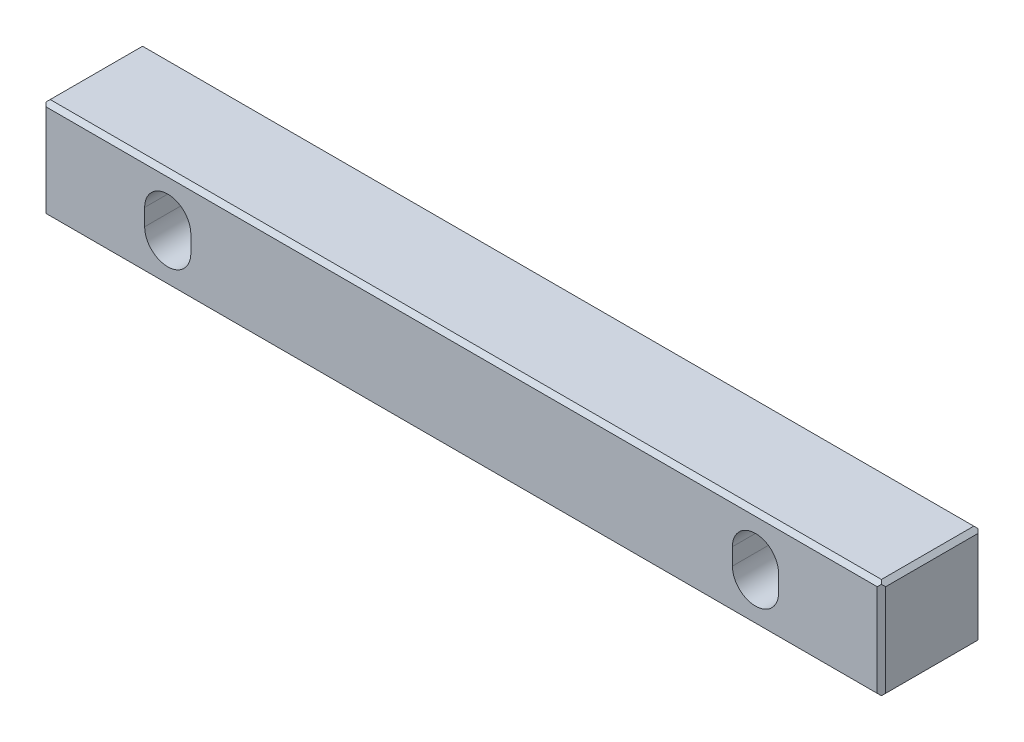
ISO-10303-21;
HEADER;
FILE_DESCRIPTION(('STEP AP214'),'2;1');
FILE_NAME('part.step','',(''),(''),'','','');
FILE_SCHEMA(('AUTOMOTIVE_DESIGN { 1 0 10303 214 1 1 1 1 }'));
ENDSEC;
DATA;
#1=APPLICATION_CONTEXT('core data for automotive mechanical design processes');
#2=APPLICATION_PROTOCOL_DEFINITION('international standard','automotive_design',2000,#1);
#3=PRODUCT_CONTEXT('',#1,'mechanical');
#4=PRODUCT('Part','Part','',(#3));
#5=PRODUCT_RELATED_PRODUCT_CATEGORY('part','',(#4));
#6=PRODUCT_DEFINITION_FORMATION('','',#4);
#7=PRODUCT_DEFINITION_CONTEXT('part definition',#1,'design');
#8=PRODUCT_DEFINITION('design','',#6,#7);
#9=PRODUCT_DEFINITION_SHAPE('','',#8);
#10=(LENGTH_UNIT() NAMED_UNIT(*) SI_UNIT(.MILLI.,.METRE.));
#11=(NAMED_UNIT(*) PLANE_ANGLE_UNIT() SI_UNIT($,.RADIAN.));
#12=(NAMED_UNIT(*) SI_UNIT($,.STERADIAN.) SOLID_ANGLE_UNIT());
#13=UNCERTAINTY_MEASURE_WITH_UNIT(LENGTH_MEASURE(1.E-05),#10,'distance_accuracy_value','');
#14=(GEOMETRIC_REPRESENTATION_CONTEXT(3) GLOBAL_UNCERTAINTY_ASSIGNED_CONTEXT((#13)) GLOBAL_UNIT_ASSIGNED_CONTEXT((#10,
#11,#12)) REPRESENTATION_CONTEXT('',''));
#15=CARTESIAN_POINT('',(0.,0.,0.));
#16=DIRECTION('',(0.,0.,1.));
#17=DIRECTION('',(1.,0.,0.));
#18=AXIS2_PLACEMENT_3D('',#15,#16,#17);
#19=CARTESIAN_POINT('',(371.720096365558,-215.4,188.52));
#20=DIRECTION('',(0.,-1.,0.));
#21=DIRECTION('',(0.,0.,-1.));
#22=AXIS2_PLACEMENT_3D('',#19,#20,#21);
#23=PLANE('',#22);
#24=DIRECTION('',(0.,0.,1.));
#25=VECTOR('',#24,1.);
#26=CARTESIAN_POINT('',(471.220096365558,-215.4,182.52));
#27=LINE('',#26,#25);
#28=CARTESIAN_POINT('',(471.220096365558,-215.4,188.02));
#29=VERTEX_POINT('',#28);
#30=CARTESIAN_POINT('',(471.220096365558,-215.4,177.02));
#31=VERTEX_POINT('',#30);
#32=EDGE_CURVE('E284',#29,#31,#27,.F.);
#33=ORIENTED_EDGE('',*,*,#32,.F.);
#34=DIRECTION('',(1.,0.,0.));
#35=VECTOR('',#34,1.);
#36=CARTESIAN_POINT('',(421.720096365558,-215.4,188.02));
#37=LINE('',#36,#35);
#38=CARTESIAN_POINT('',(372.220096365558,-215.4,188.02));
#39=VERTEX_POINT('',#38);
#40=EDGE_CURVE('E233',#39,#29,#37,.T.);
#41=ORIENTED_EDGE('',*,*,#40,.F.);
#42=DIRECTION('',(0.,0.,1.));
#43=VECTOR('',#42,1.);
#44=CARTESIAN_POINT('',(372.220096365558,-215.4,182.52));
#45=LINE('',#44,#43);
#46=CARTESIAN_POINT('',(372.220096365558,-215.4,177.02));
#47=VERTEX_POINT('',#46);
#48=EDGE_CURVE('E264',#47,#39,#45,.T.);
#49=ORIENTED_EDGE('',*,*,#48,.F.);
#50=DIRECTION('',(1.,0.,0.));
#51=VECTOR('',#50,1.);
#52=CARTESIAN_POINT('',(421.720096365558,-215.4,177.02));
#53=LINE('',#52,#51);
#54=EDGE_CURVE('E276',#47,#31,#53,.T.);
#55=ORIENTED_EDGE('',*,*,#54,.T.);
#56=EDGE_LOOP('',(#33,#41,#49,#55));
#57=FACE_BOUND('',#56,.T.);
#58=ADVANCED_FACE('F16',(#57),#23,.T.);
#59=CARTESIAN_POINT('',(471.470096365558,-215.15,182.52));
#60=DIRECTION('',(0.707106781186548,-0.707106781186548,0.));
#61=DIRECTION('',(0.707106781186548,0.707106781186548,0.));
#62=AXIS2_PLACEMENT_3D('',#59,#60,#61);
#63=PLANE('',#62);
#64=DIRECTION('',(0.577350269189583,0.577350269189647,-0.577350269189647));
#65=VECTOR('',#64,1.);
#66=CARTESIAN_POINT('',(471.220096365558,-215.4,177.02));
#67=LINE('',#66,#65);
#68=CARTESIAN_POINT('',(471.470096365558,-215.15,176.77));
#69=VERTEX_POINT('',#68);
#70=EDGE_CURVE('E274',#31,#69,#67,.T.);
#71=ORIENTED_EDGE('',*,*,#70,.T.);
#72=DIRECTION('',(0.577350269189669,0.577350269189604,0.577350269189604));
#73=VECTOR('',#72,1.);
#74=CARTESIAN_POINT('',(471.470096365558,-215.15,176.77));
#75=LINE('',#74,#73);
#76=CARTESIAN_POINT('',(471.720096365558,-214.9,177.02));
#77=VERTEX_POINT('',#76);
#78=EDGE_CURVE('E282',#69,#77,#75,.T.);
#79=ORIENTED_EDGE('',*,*,#78,.T.);
#80=DIRECTION('',(0.,0.,-1.));
#81=VECTOR('',#80,1.);
#82=CARTESIAN_POINT('',(471.720096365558,-214.9,188.52));
#83=LINE('',#82,#81);
#84=CARTESIAN_POINT('',(471.720096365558,-214.9,188.02));
#85=VERTEX_POINT('',#84);
#86=EDGE_CURVE('E211',#85,#77,#83,.T.);
#87=ORIENTED_EDGE('',*,*,#86,.F.);
#88=DIRECTION('',(0.577350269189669,0.577350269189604,-0.577350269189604));
#89=VECTOR('',#88,1.);
#90=CARTESIAN_POINT('',(471.470096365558,-215.15,188.27));
#91=LINE('',#90,#89);
#92=CARTESIAN_POINT('',(471.470096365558,-215.15,188.27));
#93=VERTEX_POINT('',#92);
#94=EDGE_CURVE('E244',#93,#85,#91,.T.);
#95=ORIENTED_EDGE('',*,*,#94,.F.);
#96=DIRECTION('',(0.577350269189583,0.577350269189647,0.577350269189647));
#97=VECTOR('',#96,1.);
#98=CARTESIAN_POINT('',(471.220096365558,-215.4,188.02));
#99=LINE('',#98,#97);
#100=EDGE_CURVE('E230',#29,#93,#99,.T.);
#101=ORIENTED_EDGE('',*,*,#100,.F.);
#102=ORIENTED_EDGE('',*,*,#32,.T.);
#103=EDGE_LOOP('',(#71,#79,#87,#95,#101,#102));
#104=FACE_BOUND('',#103,.T.);
#105=ADVANCED_FACE('F427',(#104),#63,.T.);
#106=CARTESIAN_POINT('',(471.470096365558,-209.4,176.77));
#107=DIRECTION('',(-0.707106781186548,0.,0.707106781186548));
#108=DIRECTION('',(0.707106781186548,0.,0.707106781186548));
#109=AXIS2_PLACEMENT_3D('',#106,#107,#108);
#110=PLANE('',#109);
#111=DIRECTION('',(-0.577350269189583,-0.577350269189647,-0.577350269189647));
#112=VECTOR('',#111,1.);
#113=CARTESIAN_POINT('',(471.470096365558,-203.65,176.77));
#114=LINE('',#113,#112);
#115=CARTESIAN_POINT('',(471.470096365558,-203.65,176.77));
#116=VERTEX_POINT('',#115);
#117=CARTESIAN_POINT('',(471.220096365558,-203.9,176.52));
#118=VERTEX_POINT('',#117);
#119=EDGE_CURVE('E278',#116,#118,#114,.T.);
#120=ORIENTED_EDGE('',*,*,#119,.F.);
#121=DIRECTION('',(-0.577350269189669,0.577350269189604,-0.577350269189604));
#122=VECTOR('',#121,1.);
#123=CARTESIAN_POINT('',(471.720096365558,-203.9,177.02));
#124=LINE('',#123,#122);
#125=CARTESIAN_POINT('',(471.720096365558,-203.9,177.02));
#126=VERTEX_POINT('',#125);
#127=EDGE_CURVE('E280',#126,#116,#124,.T.);
#128=ORIENTED_EDGE('',*,*,#127,.F.);
#129=DIRECTION('',(0.,1.,0.));
#130=VECTOR('',#129,1.);
#131=CARTESIAN_POINT('',(471.720096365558,-215.4,177.02));
#132=LINE('',#131,#130);
#133=EDGE_CURVE('E204',#77,#126,#132,.T.);
#134=ORIENTED_EDGE('',*,*,#133,.F.);
#135=ORIENTED_EDGE('',*,*,#78,.F.);
#136=DIRECTION('',(-0.577350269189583,0.577350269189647,-0.577350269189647));
#137=VECTOR('',#136,1.);
#138=CARTESIAN_POINT('',(471.470096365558,-215.15,176.77));
#139=LINE('',#138,#137);
#140=CARTESIAN_POINT('',(471.220096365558,-214.9,176.52));
#141=VERTEX_POINT('',#140);
#142=EDGE_CURVE('E272',#69,#141,#139,.T.);
#143=ORIENTED_EDGE('',*,*,#142,.T.);
#144=DIRECTION('',(0.,1.,0.));
#145=VECTOR('',#144,1.);
#146=CARTESIAN_POINT('',(471.220096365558,78.6,176.52));
#147=LINE('',#146,#145);
#148=EDGE_CURVE('E312',#118,#141,#147,.F.);
#149=ORIENTED_EDGE('',*,*,#148,.F.);
#150=EDGE_LOOP('',(#120,#128,#134,#135,#143,#149));
#151=FACE_BOUND('',#150,.T.);
#152=ADVANCED_FACE('F409',(#151),#110,.F.);
#153=CARTESIAN_POINT('',(421.720096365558,-215.15,176.77));
#154=DIRECTION('',(0.,0.707106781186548,0.707106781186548));
#155=DIRECTION('',(0.,-0.707106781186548,0.707106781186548));
#156=AXIS2_PLACEMENT_3D('',#153,#154,#155);
#157=PLANE('',#156);
#158=ORIENTED_EDGE('',*,*,#142,.F.);
#159=ORIENTED_EDGE('',*,*,#70,.F.);
#160=ORIENTED_EDGE('',*,*,#54,.F.);
#161=DIRECTION('',(0.577350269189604,-0.577350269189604,0.577350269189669));
#162=VECTOR('',#161,1.);
#163=CARTESIAN_POINT('',(371.970096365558,-215.15,176.77));
#164=LINE('',#163,#162);
#165=CARTESIAN_POINT('',(371.970096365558,-215.15,176.77));
#166=VERTEX_POINT('',#165);
#167=EDGE_CURVE('E258',#166,#47,#164,.T.);
#168=ORIENTED_EDGE('',*,*,#167,.F.);
#169=DIRECTION('',(0.577350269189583,0.577350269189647,-0.577350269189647));
#170=VECTOR('',#169,1.);
#171=CARTESIAN_POINT('',(371.970096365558,-215.15,176.77));
#172=LINE('',#171,#170);
#173=CARTESIAN_POINT('',(372.220096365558,-214.9,176.52));
#174=VERTEX_POINT('',#173);
#175=EDGE_CURVE('E266',#166,#174,#172,.T.);
#176=ORIENTED_EDGE('',*,*,#175,.T.);
#177=DIRECTION('',(-1.,0.,0.));
#178=VECTOR('',#177,1.);
#179=CARTESIAN_POINT('',(512.25,-214.9,176.52));
#180=LINE('',#179,#178);
#181=EDGE_CURVE('E315',#141,#174,#180,.T.);
#182=ORIENTED_EDGE('',*,*,#181,.F.);
#183=EDGE_LOOP('',(#158,#159,#160,#168,#176,#182));
#184=FACE_BOUND('',#183,.T.);
#185=ADVANCED_FACE('F418',(#184),#157,.F.);
#186=CARTESIAN_POINT('',(371.970096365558,-209.4,176.77));
#187=DIRECTION('',(0.707106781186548,0.,0.707106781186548));
#188=DIRECTION('',(0.707106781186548,0.,-0.707106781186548));
#189=AXIS2_PLACEMENT_3D('',#186,#187,#188);
#190=PLANE('',#189);
#191=ORIENTED_EDGE('',*,*,#175,.F.);
#192=DIRECTION('',(0.577350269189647,-0.577350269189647,-0.577350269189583));
#193=VECTOR('',#192,1.);
#194=CARTESIAN_POINT('',(371.720096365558,-214.9,177.02));
#195=LINE('',#194,#193);
#196=CARTESIAN_POINT('',(371.720096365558,-214.9,177.02));
#197=VERTEX_POINT('',#196);
#198=EDGE_CURVE('E261',#197,#166,#195,.T.);
#199=ORIENTED_EDGE('',*,*,#198,.F.);
#200=DIRECTION('',(0.,1.,0.));
#201=VECTOR('',#200,1.);
#202=CARTESIAN_POINT('',(371.720096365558,-203.4,177.02));
#203=LINE('',#202,#201);
#204=CARTESIAN_POINT('',(371.720096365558,-203.9,177.02));
#205=VERTEX_POINT('',#204);
#206=EDGE_CURVE('E324',#205,#197,#203,.F.);
#207=ORIENTED_EDGE('',*,*,#206,.F.);
#208=DIRECTION('',(-0.577350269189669,-0.577350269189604,0.577350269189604));
#209=VECTOR('',#208,1.);
#210=CARTESIAN_POINT('',(371.970096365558,-203.65,176.77));
#211=LINE('',#210,#209);
#212=CARTESIAN_POINT('',(371.970096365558,-203.65,176.77));
#213=VERTEX_POINT('',#212);
#214=EDGE_CURVE('E268',#213,#205,#211,.T.);
#215=ORIENTED_EDGE('',*,*,#214,.F.);
#216=DIRECTION('',(-0.577350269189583,0.577350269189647,0.577350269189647));
#217=VECTOR('',#216,1.);
#218=CARTESIAN_POINT('',(372.220096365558,-203.9,176.52));
#219=LINE('',#218,#217);
#220=CARTESIAN_POINT('',(372.220096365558,-203.9,176.52));
#221=VERTEX_POINT('',#220);
#222=EDGE_CURVE('E270',#221,#213,#219,.T.);
#223=ORIENTED_EDGE('',*,*,#222,.F.);
#224=DIRECTION('',(0.,1.,0.));
#225=VECTOR('',#224,1.);
#226=CARTESIAN_POINT('',(372.220096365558,78.6,176.52));
#227=LINE('',#226,#225);
#228=EDGE_CURVE('E318',#174,#221,#227,.T.);
#229=ORIENTED_EDGE('',*,*,#228,.F.);
#230=EDGE_LOOP('',(#191,#199,#207,#215,#223,#229));
#231=FACE_BOUND('',#230,.T.);
#232=ADVANCED_FACE('F377',(#231),#190,.F.);
#233=CARTESIAN_POINT('',(371.970096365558,-215.15,182.52));
#234=DIRECTION('',(-0.707106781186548,-0.707106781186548,0.));
#235=DIRECTION('',(0.707106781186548,-0.707106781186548,0.));
#236=AXIS2_PLACEMENT_3D('',#233,#234,#235);
#237=PLANE('',#236);
#238=ORIENTED_EDGE('',*,*,#198,.T.);
#239=ORIENTED_EDGE('',*,*,#167,.T.);
#240=ORIENTED_EDGE('',*,*,#48,.T.);
#241=DIRECTION('',(0.577350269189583,-0.577350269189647,-0.577350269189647));
#242=VECTOR('',#241,1.);
#243=CARTESIAN_POINT('',(371.970096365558,-215.15,188.27));
#244=LINE('',#243,#242);
#245=CARTESIAN_POINT('',(371.970096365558,-215.15,188.27));
#246=VERTEX_POINT('',#245);
#247=EDGE_CURVE('E236',#246,#39,#244,.T.);
#248=ORIENTED_EDGE('',*,*,#247,.F.);
#249=DIRECTION('',(0.577350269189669,-0.577350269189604,0.577350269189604));
#250=VECTOR('',#249,1.);
#251=CARTESIAN_POINT('',(371.720096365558,-214.9,188.02));
#252=LINE('',#251,#250);
#253=CARTESIAN_POINT('',(371.720096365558,-214.9,188.02));
#254=VERTEX_POINT('',#253);
#255=EDGE_CURVE('E219',#254,#246,#252,.T.);
#256=ORIENTED_EDGE('',*,*,#255,.F.);
#257=DIRECTION('',(0.,0.,1.));
#258=VECTOR('',#257,1.);
#259=CARTESIAN_POINT('',(371.720096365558,-214.9,188.52));
#260=LINE('',#259,#258);
#261=EDGE_CURVE('E327',#197,#254,#260,.T.);
#262=ORIENTED_EDGE('',*,*,#261,.F.);
#263=EDGE_LOOP('',(#238,#239,#240,#248,#256,#262));
#264=FACE_BOUND('',#263,.T.);
#265=ADVANCED_FACE('F421',(#264),#237,.T.);
#266=CARTESIAN_POINT('',(389.470096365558,-210.4,189.7200024));
#267=DIRECTION('',(1.,0.,0.));
#268=DIRECTION('',(0.,0.,-1.));
#269=AXIS2_PLACEMENT_3D('',#266,#267,#268);
#270=PLANE('',#269);
#271=DIRECTION('',(0.,0.,-1.));
#272=VECTOR('',#271,1.);
#273=CARTESIAN_POINT('',(389.470096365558,-210.4,189.7200024));
#274=LINE('',#273,#272);
#275=CARTESIAN_POINT('',(389.470096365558,-210.4,176.52));
#276=VERTEX_POINT('',#275);
#277=CARTESIAN_POINT('',(389.470096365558,-210.4,188.52));
#278=VERTEX_POINT('',#277);
#279=EDGE_CURVE('E179',#276,#278,#274,.F.);
#280=ORIENTED_EDGE('',*,*,#279,.T.);
#281=DIRECTION('',(0.,1.,0.));
#282=VECTOR('',#281,1.);
#283=CARTESIAN_POINT('',(389.470096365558,78.6,188.52));
#284=LINE('',#283,#282);
#285=CARTESIAN_POINT('',(389.470096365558,-208.4,188.52));
#286=VERTEX_POINT('',#285);
#287=EDGE_CURVE('E299',#278,#286,#284,.T.);
#288=ORIENTED_EDGE('',*,*,#287,.T.);
#289=DIRECTION('',(0.,0.,-1.));
#290=VECTOR('',#289,1.);
#291=CARTESIAN_POINT('',(389.470096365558,-208.4,189.7200024));
#292=LINE('',#291,#290);
#293=CARTESIAN_POINT('',(389.470096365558,-208.4,176.52));
#294=VERTEX_POINT('',#293);
#295=EDGE_CURVE('E194',#286,#294,#292,.T.);
#296=ORIENTED_EDGE('',*,*,#295,.T.);
#297=DIRECTION('',(0.,1.,0.));
#298=VECTOR('',#297,1.);
#299=CARTESIAN_POINT('',(389.470096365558,78.6,176.52));
#300=LINE('',#299,#298);
#301=EDGE_CURVE('E191',#276,#294,#300,.T.);
#302=ORIENTED_EDGE('',*,*,#301,.F.);
#303=EDGE_LOOP('',(#280,#288,#296,#302));
#304=FACE_BOUND('',#303,.T.);
#305=ADVANCED_FACE('F192',(#304),#270,.F.);
#306=CARTESIAN_POINT('',(386.720096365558,-208.4,189.7200024));
#307=DIRECTION('',(0.,0.,-1.));
#308=DIRECTION('',(-1.,0.,0.));
#309=AXIS2_PLACEMENT_3D('',#306,#307,#308);
#310=CYLINDRICAL_SURFACE('',#309,2.75);
#311=ORIENTED_EDGE('',*,*,#295,.F.);
#312=CARTESIAN_POINT('',(386.720096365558,-208.4,188.52));
#313=DIRECTION('',(0.,0.,-1.));
#314=DIRECTION('',(-1.,0.,0.));
#315=AXIS2_PLACEMENT_3D('',#312,#313,#314);
#316=CIRCLE('',#315,2.75);
#317=CARTESIAN_POINT('',(383.970096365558,-208.4,188.52));
#318=VERTEX_POINT('',#317);
#319=EDGE_CURVE('E297',#286,#318,#316,.F.);
#320=ORIENTED_EDGE('',*,*,#319,.T.);
#321=DIRECTION('',(0.,0.,1.));
#322=VECTOR('',#321,1.);
#323=CARTESIAN_POINT('',(383.970096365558,-208.4,189.7200024));
#324=LINE('',#323,#322);
#325=CARTESIAN_POINT('',(383.970096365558,-208.4,176.52));
#326=VERTEX_POINT('',#325);
#327=EDGE_CURVE('E255',#318,#326,#324,.F.);
#328=ORIENTED_EDGE('',*,*,#327,.T.);
#329=CARTESIAN_POINT('',(386.720096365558,-208.4,176.52));
#330=DIRECTION('',(0.,0.,-1.));
#331=DIRECTION('',(-1.,0.,0.));
#332=AXIS2_PLACEMENT_3D('',#329,#330,#331);
#333=CIRCLE('',#332,2.75);
#334=EDGE_CURVE('E198',#294,#326,#333,.F.);
#335=ORIENTED_EDGE('',*,*,#334,.F.);
#336=EDGE_LOOP('',(#311,#320,#328,#335));
#337=FACE_BOUND('',#336,.T.);
#338=ADVANCED_FACE('F484',(#337),#310,.F.);
#339=CARTESIAN_POINT('',(383.970096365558,-208.4,189.7200024));
#340=DIRECTION('',(-1.,0.,0.));
#341=DIRECTION('',(0.,0.,1.));
#342=AXIS2_PLACEMENT_3D('',#339,#340,#341);
#343=PLANE('',#342);
#344=ORIENTED_EDGE('',*,*,#327,.F.);
#345=DIRECTION('',(0.,1.,0.));
#346=VECTOR('',#345,1.);
#347=CARTESIAN_POINT('',(383.970096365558,78.6,188.52));
#348=LINE('',#347,#346);
#349=CARTESIAN_POINT('',(383.970096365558,-210.4,188.52));
#350=VERTEX_POINT('',#349);
#351=EDGE_CURVE('E296',#318,#350,#348,.F.);
#352=ORIENTED_EDGE('',*,*,#351,.T.);
#353=DIRECTION('',(0.,0.,-1.));
#354=VECTOR('',#353,1.);
#355=CARTESIAN_POINT('',(383.970096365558,-210.4,189.7200024));
#356=LINE('',#355,#354);
#357=CARTESIAN_POINT('',(383.970096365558,-210.4,176.52));
#358=VERTEX_POINT('',#357);
#359=EDGE_CURVE('E174',#350,#358,#356,.T.);
#360=ORIENTED_EDGE('',*,*,#359,.T.);
#361=DIRECTION('',(0.,1.,0.));
#362=VECTOR('',#361,1.);
#363=CARTESIAN_POINT('',(383.970096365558,78.6,176.52));
#364=LINE('',#363,#362);
#365=EDGE_CURVE('E201',#326,#358,#364,.F.);
#366=ORIENTED_EDGE('',*,*,#365,.F.);
#367=EDGE_LOOP('',(#344,#352,#360,#366));
#368=FACE_BOUND('',#367,.T.);
#369=ADVANCED_FACE('F481',(#368),#343,.F.);
#370=CARTESIAN_POINT('',(386.720096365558,-210.4,189.7200024));
#371=DIRECTION('',(0.,0.,-1.));
#372=DIRECTION('',(-1.,0.,0.));
#373=AXIS2_PLACEMENT_3D('',#370,#371,#372);
#374=CYLINDRICAL_SURFACE('',#373,2.75);
#375=ORIENTED_EDGE('',*,*,#279,.F.);
#376=CARTESIAN_POINT('',(386.720096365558,-210.4,176.52));
#377=DIRECTION('',(0.,0.,-1.));
#378=DIRECTION('',(-1.,0.,0.));
#379=AXIS2_PLACEMENT_3D('',#376,#377,#378);
#380=CIRCLE('',#379,2.75);
#381=EDGE_CURVE('E19',#358,#276,#380,.F.);
#382=ORIENTED_EDGE('',*,*,#381,.F.);
#383=ORIENTED_EDGE('',*,*,#359,.F.);
#384=CARTESIAN_POINT('',(386.720096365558,-210.4,188.52));
#385=DIRECTION('',(0.,0.,-1.));
#386=DIRECTION('',(-1.,0.,0.));
#387=AXIS2_PLACEMENT_3D('',#384,#385,#386);
#388=CIRCLE('',#387,2.75);
#389=EDGE_CURVE('E185',#350,#278,#388,.F.);
#390=ORIENTED_EDGE('',*,*,#389,.T.);
#391=EDGE_LOOP('',(#375,#382,#383,#390));
#392=FACE_BOUND('',#391,.T.);
#393=ADVANCED_FACE('F181',(#392),#374,.F.);
#394=CARTESIAN_POINT('',(459.470096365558,-210.4,189.7200024));
#395=DIRECTION('',(1.,0.,0.));
#396=DIRECTION('',(0.,0.,-1.));
#397=AXIS2_PLACEMENT_3D('',#394,#395,#396);
#398=PLANE('',#397);
#399=DIRECTION('',(0.,0.,-1.));
#400=VECTOR('',#399,1.);
#401=CARTESIAN_POINT('',(459.470096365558,-208.4,189.7200024));
#402=LINE('',#401,#400);
#403=CARTESIAN_POINT('',(459.470096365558,-208.4,188.52));
#404=VERTEX_POINT('',#403);
#405=CARTESIAN_POINT('',(459.470096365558,-208.4,176.52));
#406=VERTEX_POINT('',#405);
#407=EDGE_CURVE('E188',#404,#406,#402,.T.);
#408=ORIENTED_EDGE('',*,*,#407,.T.);
#409=DIRECTION('',(0.,1.,0.));
#410=VECTOR('',#409,1.);
#411=CARTESIAN_POINT('',(459.470096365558,78.6,176.52));
#412=LINE('',#411,#410);
#413=CARTESIAN_POINT('',(459.470096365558,-210.4,176.52));
#414=VERTEX_POINT('',#413);
#415=EDGE_CURVE('E304',#414,#406,#412,.T.);
#416=ORIENTED_EDGE('',*,*,#415,.F.);
#417=DIRECTION('',(0.,0.,-1.));
#418=VECTOR('',#417,1.);
#419=CARTESIAN_POINT('',(459.470096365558,-210.4,189.7200024));
#420=LINE('',#419,#418);
#421=CARTESIAN_POINT('',(459.470096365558,-210.4,188.52));
#422=VERTEX_POINT('',#421);
#423=EDGE_CURVE('E247',#414,#422,#420,.F.);
#424=ORIENTED_EDGE('',*,*,#423,.T.);
#425=DIRECTION('',(0.,1.,0.));
#426=VECTOR('',#425,1.);
#427=CARTESIAN_POINT('',(459.470096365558,78.6,188.52));
#428=LINE('',#427,#426);
#429=EDGE_CURVE('E294',#422,#404,#428,.T.);
#430=ORIENTED_EDGE('',*,*,#429,.T.);
#431=EDGE_LOOP('',(#408,#416,#424,#430));
#432=FACE_BOUND('',#431,.T.);
#433=ADVANCED_FACE('F474',(#432),#398,.F.);
#434=CARTESIAN_POINT('',(456.720096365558,-208.4,189.7200024));
#435=DIRECTION('',(0.,0.,-1.));
#436=DIRECTION('',(-1.,0.,0.));
#437=AXIS2_PLACEMENT_3D('',#434,#435,#436);
#438=CYLINDRICAL_SURFACE('',#437,2.75);
#439=DIRECTION('',(0.,0.,1.));
#440=VECTOR('',#439,1.);
#441=CARTESIAN_POINT('',(453.970096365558,-208.4,189.7200024));
#442=LINE('',#441,#440);
#443=CARTESIAN_POINT('',(453.970096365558,-208.4,188.52));
#444=VERTEX_POINT('',#443);
#445=CARTESIAN_POINT('',(453.970096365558,-208.4,176.52));
#446=VERTEX_POINT('',#445);
#447=EDGE_CURVE('E251',#444,#446,#442,.F.);
#448=ORIENTED_EDGE('',*,*,#447,.T.);
#449=CARTESIAN_POINT('',(456.720096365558,-208.4,176.52));
#450=DIRECTION('',(0.,0.,-1.));
#451=DIRECTION('',(-1.,0.,0.));
#452=AXIS2_PLACEMENT_3D('',#449,#450,#451);
#453=CIRCLE('',#452,2.75);
#454=EDGE_CURVE('E300',#406,#446,#453,.F.);
#455=ORIENTED_EDGE('',*,*,#454,.F.);
#456=ORIENTED_EDGE('',*,*,#407,.F.);
#457=CARTESIAN_POINT('',(456.720096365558,-208.4,188.52));
#458=DIRECTION('',(0.,0.,-1.));
#459=DIRECTION('',(-1.,0.,0.));
#460=AXIS2_PLACEMENT_3D('',#457,#458,#459);
#461=CIRCLE('',#460,2.75);
#462=EDGE_CURVE('E292',#404,#444,#461,.F.);
#463=ORIENTED_EDGE('',*,*,#462,.T.);
#464=EDGE_LOOP('',(#448,#455,#456,#463));
#465=FACE_BOUND('',#464,.T.);
#466=ADVANCED_FACE('F470',(#465),#438,.F.);
#467=CARTESIAN_POINT('',(453.970096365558,-208.4,189.7200024));
#468=DIRECTION('',(-1.,0.,0.));
#469=DIRECTION('',(0.,0.,1.));
#470=AXIS2_PLACEMENT_3D('',#467,#468,#469);
#471=PLANE('',#470);
#472=DIRECTION('',(0.,0.,-1.));
#473=VECTOR('',#472,1.);
#474=CARTESIAN_POINT('',(453.970096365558,-210.4,189.7200024));
#475=LINE('',#474,#473);
#476=CARTESIAN_POINT('',(453.970096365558,-210.4,188.52));
#477=VERTEX_POINT('',#476);
#478=CARTESIAN_POINT('',(453.970096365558,-210.4,176.52));
#479=VERTEX_POINT('',#478);
#480=EDGE_CURVE('E249',#477,#479,#475,.T.);
#481=ORIENTED_EDGE('',*,*,#480,.T.);
#482=DIRECTION('',(0.,1.,0.));
#483=VECTOR('',#482,1.);
#484=CARTESIAN_POINT('',(453.970096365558,78.6,176.52));
#485=LINE('',#484,#483);
#486=EDGE_CURVE('E303',#446,#479,#485,.F.);
#487=ORIENTED_EDGE('',*,*,#486,.F.);
#488=ORIENTED_EDGE('',*,*,#447,.F.);
#489=DIRECTION('',(0.,1.,0.));
#490=VECTOR('',#489,1.);
#491=CARTESIAN_POINT('',(453.970096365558,78.6,188.52));
#492=LINE('',#491,#490);
#493=EDGE_CURVE('E291',#444,#477,#492,.F.);
#494=ORIENTED_EDGE('',*,*,#493,.T.);
#495=EDGE_LOOP('',(#481,#487,#488,#494));
#496=FACE_BOUND('',#495,.T.);
#497=ADVANCED_FACE('F466',(#496),#471,.F.);
#498=CARTESIAN_POINT('',(456.720096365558,-210.4,189.7200024));
#499=DIRECTION('',(0.,0.,-1.));
#500=DIRECTION('',(-1.,0.,0.));
#501=AXIS2_PLACEMENT_3D('',#498,#499,#500);
#502=CYLINDRICAL_SURFACE('',#501,2.75);
#503=ORIENTED_EDGE('',*,*,#423,.F.);
#504=CARTESIAN_POINT('',(456.720096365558,-210.4,176.52));
#505=DIRECTION('',(0.,0.,-1.));
#506=DIRECTION('',(-1.,0.,0.));
#507=AXIS2_PLACEMENT_3D('',#504,#505,#506);
#508=CIRCLE('',#507,2.75);
#509=EDGE_CURVE('E305',#479,#414,#508,.F.);
#510=ORIENTED_EDGE('',*,*,#509,.F.);
#511=ORIENTED_EDGE('',*,*,#480,.F.);
#512=CARTESIAN_POINT('',(456.720096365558,-210.4,188.52));
#513=DIRECTION('',(0.,0.,-1.));
#514=DIRECTION('',(-1.,0.,0.));
#515=AXIS2_PLACEMENT_3D('',#512,#513,#514);
#516=CIRCLE('',#515,2.75);
#517=EDGE_CURVE('E287',#477,#422,#516,.F.);
#518=ORIENTED_EDGE('',*,*,#517,.T.);
#519=EDGE_LOOP('',(#503,#510,#511,#518));
#520=FACE_BOUND('',#519,.T.);
#521=ADVANCED_FACE('F463',(#520),#502,.F.);
#522=CARTESIAN_POINT('',(471.470096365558,-209.4,188.27));
#523=DIRECTION('',(0.707106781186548,0.,0.707106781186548));
#524=DIRECTION('',(0.707106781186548,0.,-0.707106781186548));
#525=AXIS2_PLACEMENT_3D('',#522,#523,#524);
#526=PLANE('',#525);
#527=DIRECTION('',(-0.577350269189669,0.577350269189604,0.577350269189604));
#528=VECTOR('',#527,1.);
#529=CARTESIAN_POINT('',(471.720096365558,-203.9,188.02));
#530=LINE('',#529,#528);
#531=CARTESIAN_POINT('',(471.720096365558,-203.9,188.02));
#532=VERTEX_POINT('',#531);
#533=CARTESIAN_POINT('',(471.470096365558,-203.65,188.27));
#534=VERTEX_POINT('',#533);
#535=EDGE_CURVE('E241',#532,#534,#530,.T.);
#536=ORIENTED_EDGE('',*,*,#535,.T.);
#537=DIRECTION('',(-0.577350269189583,-0.577350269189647,0.577350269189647));
#538=VECTOR('',#537,1.);
#539=CARTESIAN_POINT('',(471.470096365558,-203.65,188.27));
#540=LINE('',#539,#538);
#541=CARTESIAN_POINT('',(471.220096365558,-203.9,188.52));
#542=VERTEX_POINT('',#541);
#543=EDGE_CURVE('E239',#534,#542,#540,.T.);
#544=ORIENTED_EDGE('',*,*,#543,.T.);
#545=DIRECTION('',(0.,1.,0.));
#546=VECTOR('',#545,1.);
#547=CARTESIAN_POINT('',(471.220096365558,78.6,188.52));
#548=LINE('',#547,#546);
#549=CARTESIAN_POINT('',(471.220096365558,-214.9,188.52));
#550=VERTEX_POINT('',#549);
#551=EDGE_CURVE('E290',#542,#550,#548,.F.);
#552=ORIENTED_EDGE('',*,*,#551,.T.);
#553=DIRECTION('',(-0.577350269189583,0.577350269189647,0.577350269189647));
#554=VECTOR('',#553,1.);
#555=CARTESIAN_POINT('',(471.470096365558,-215.15,188.27));
#556=LINE('',#555,#554);
#557=EDGE_CURVE('E227',#93,#550,#556,.T.);
#558=ORIENTED_EDGE('',*,*,#557,.F.);
#559=ORIENTED_EDGE('',*,*,#94,.T.);
#560=DIRECTION('',(0.,1.,0.));
#561=VECTOR('',#560,1.);
#562=CARTESIAN_POINT('',(471.720096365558,-215.4,188.02));
#563=LINE('',#562,#561);
#564=EDGE_CURVE('E202',#532,#85,#563,.F.);
#565=ORIENTED_EDGE('',*,*,#564,.F.);
#566=EDGE_LOOP('',(#536,#544,#552,#558,#559,#565));
#567=FACE_BOUND('',#566,.T.);
#568=ADVANCED_FACE('F399',(#567),#526,.T.);
#569=CARTESIAN_POINT('',(421.720096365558,-215.15,188.27));
#570=DIRECTION('',(0.,-0.707106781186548,0.707106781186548));
#571=DIRECTION('',(0.,-0.707106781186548,-0.707106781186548));
#572=AXIS2_PLACEMENT_3D('',#569,#570,#571);
#573=PLANE('',#572);
#574=ORIENTED_EDGE('',*,*,#100,.T.);
#575=ORIENTED_EDGE('',*,*,#557,.T.);
#576=DIRECTION('',(-1.,0.,0.));
#577=VECTOR('',#576,1.);
#578=CARTESIAN_POINT('',(512.25,-214.9,188.52));
#579=LINE('',#578,#577);
#580=CARTESIAN_POINT('',(372.220096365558,-214.9,188.52));
#581=VERTEX_POINT('',#580);
#582=EDGE_CURVE('E335',#550,#581,#579,.T.);
#583=ORIENTED_EDGE('',*,*,#582,.T.);
#584=DIRECTION('',(0.577350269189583,0.577350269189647,0.577350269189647));
#585=VECTOR('',#584,1.);
#586=CARTESIAN_POINT('',(371.970096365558,-215.15,188.27));
#587=LINE('',#586,#585);
#588=EDGE_CURVE('E216',#246,#581,#587,.T.);
#589=ORIENTED_EDGE('',*,*,#588,.F.);
#590=ORIENTED_EDGE('',*,*,#247,.T.);
#591=ORIENTED_EDGE('',*,*,#40,.T.);
#592=EDGE_LOOP('',(#574,#575,#583,#589,#590,#591));
#593=FACE_BOUND('',#592,.T.);
#594=ADVANCED_FACE('F424',(#593),#573,.T.);
#595=CARTESIAN_POINT('',(371.970096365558,-209.4,188.27));
#596=DIRECTION('',(-0.707106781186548,0.,0.707106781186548));
#597=DIRECTION('',(0.707106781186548,0.,0.707106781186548));
#598=AXIS2_PLACEMENT_3D('',#595,#596,#597);
#599=PLANE('',#598);
#600=ORIENTED_EDGE('',*,*,#255,.T.);
#601=ORIENTED_EDGE('',*,*,#588,.T.);
#602=DIRECTION('',(0.,1.,0.));
#603=VECTOR('',#602,1.);
#604=CARTESIAN_POINT('',(372.220096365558,78.6,188.52));
#605=LINE('',#604,#603);
#606=CARTESIAN_POINT('',(372.220096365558,-203.9,188.52));
#607=VERTEX_POINT('',#606);
#608=EDGE_CURVE('E337',#581,#607,#605,.T.);
#609=ORIENTED_EDGE('',*,*,#608,.T.);
#610=DIRECTION('',(-0.577350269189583,0.577350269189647,-0.577350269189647));
#611=VECTOR('',#610,1.);
#612=CARTESIAN_POINT('',(372.220096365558,-203.9,188.52));
#613=LINE('',#612,#611);
#614=CARTESIAN_POINT('',(371.970096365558,-203.65,188.27));
#615=VERTEX_POINT('',#614);
#616=EDGE_CURVE('E224',#607,#615,#613,.T.);
#617=ORIENTED_EDGE('',*,*,#616,.T.);
#618=DIRECTION('',(-0.577350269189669,-0.577350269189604,-0.577350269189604));
#619=VECTOR('',#618,1.);
#620=CARTESIAN_POINT('',(371.970096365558,-203.65,188.27));
#621=LINE('',#620,#619);
#622=CARTESIAN_POINT('',(371.720096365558,-203.9,188.02));
#623=VERTEX_POINT('',#622);
#624=EDGE_CURVE('E222',#615,#623,#621,.T.);
#625=ORIENTED_EDGE('',*,*,#624,.T.);
#626=DIRECTION('',(0.,1.,0.));
#627=VECTOR('',#626,1.);
#628=CARTESIAN_POINT('',(371.720096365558,-203.4,188.02));
#629=LINE('',#628,#627);
#630=EDGE_CURVE('E321',#254,#623,#629,.T.);
#631=ORIENTED_EDGE('',*,*,#630,.F.);
#632=EDGE_LOOP('',(#600,#601,#609,#617,#625,#631));
#633=FACE_BOUND('',#632,.T.);
#634=ADVANCED_FACE('F386',(#633),#599,.T.);
#635=CARTESIAN_POINT('',(471.720096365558,-215.4,188.52));
#636=DIRECTION('',(1.,0.,0.));
#637=DIRECTION('',(0.,0.,-1.));
#638=AXIS2_PLACEMENT_3D('',#635,#636,#637);
#639=PLANE('',#638);
#640=DIRECTION('',(0.,0.,1.));
#641=VECTOR('',#640,1.);
#642=CARTESIAN_POINT('',(471.720096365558,-203.9,182.52));
#643=LINE('',#642,#641);
#644=EDGE_CURVE('E340',#532,#126,#643,.F.);
#645=ORIENTED_EDGE('',*,*,#644,.F.);
#646=ORIENTED_EDGE('',*,*,#564,.T.);
#647=ORIENTED_EDGE('',*,*,#86,.T.);
#648=ORIENTED_EDGE('',*,*,#133,.T.);
#649=EDGE_LOOP('',(#645,#646,#647,#648));
#650=FACE_BOUND('',#649,.T.);
#651=ADVANCED_FACE('F401',(#650),#639,.T.);
#652=CARTESIAN_POINT('',(512.25,78.6,176.52));
#653=DIRECTION('',(0.,0.,-1.));
#654=DIRECTION('',(-1.,0.,0.));
#655=AXIS2_PLACEMENT_3D('',#652,#653,#654);
#656=PLANE('',#655);
#657=ORIENTED_EDGE('',*,*,#181,.T.);
#658=ORIENTED_EDGE('',*,*,#228,.T.);
#659=DIRECTION('',(1.,0.,0.));
#660=VECTOR('',#659,1.);
#661=CARTESIAN_POINT('',(421.720096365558,-203.9,176.52));
#662=LINE('',#661,#660);
#663=EDGE_CURVE('E345',#221,#118,#662,.T.);
#664=ORIENTED_EDGE('',*,*,#663,.T.);
#665=ORIENTED_EDGE('',*,*,#148,.T.);
#666=EDGE_LOOP('',(#657,#658,#664,#665));
#667=FACE_BOUND('',#666,.T.);
#668=ORIENTED_EDGE('',*,*,#454,.T.);
#669=ORIENTED_EDGE('',*,*,#486,.T.);
#670=ORIENTED_EDGE('',*,*,#509,.T.);
#671=ORIENTED_EDGE('',*,*,#415,.T.);
#672=EDGE_LOOP('',(#668,#669,#670,#671));
#673=FACE_BOUND('',#672,.T.);
#674=ORIENTED_EDGE('',*,*,#334,.T.);
#675=ORIENTED_EDGE('',*,*,#365,.T.);
#676=ORIENTED_EDGE('',*,*,#381,.T.);
#677=ORIENTED_EDGE('',*,*,#301,.T.);
#678=EDGE_LOOP('',(#674,#675,#676,#677));
#679=FACE_BOUND('',#678,.T.);
#680=ADVANCED_FACE('F200',(#667,#673,#679),#656,.T.);
#681=CARTESIAN_POINT('',(371.720096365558,-203.4,188.52));
#682=DIRECTION('',(-1.,0.,0.));
#683=DIRECTION('',(0.,0.,1.));
#684=AXIS2_PLACEMENT_3D('',#681,#682,#683);
#685=PLANE('',#684);
#686=ORIENTED_EDGE('',*,*,#206,.T.);
#687=ORIENTED_EDGE('',*,*,#261,.T.);
#688=ORIENTED_EDGE('',*,*,#630,.T.);
#689=DIRECTION('',(0.,0.,1.));
#690=VECTOR('',#689,1.);
#691=CARTESIAN_POINT('',(371.720096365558,-203.9,182.52));
#692=LINE('',#691,#690);
#693=EDGE_CURVE('E348',#623,#205,#692,.F.);
#694=ORIENTED_EDGE('',*,*,#693,.T.);
#695=EDGE_LOOP('',(#686,#687,#688,#694));
#696=FACE_BOUND('',#695,.T.);
#697=ADVANCED_FACE('F381',(#696),#685,.T.);
#698=CARTESIAN_POINT('',(512.25,78.6,188.52));
#699=DIRECTION('',(0.,0.,-1.));
#700=DIRECTION('',(-1.,0.,0.));
#701=AXIS2_PLACEMENT_3D('',#698,#699,#700);
#702=PLANE('',#701);
#703=ORIENTED_EDGE('',*,*,#608,.F.);
#704=ORIENTED_EDGE('',*,*,#582,.F.);
#705=ORIENTED_EDGE('',*,*,#551,.F.);
#706=DIRECTION('',(1.,0.,0.));
#707=VECTOR('',#706,1.);
#708=CARTESIAN_POINT('',(421.720096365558,-203.9,188.52));
#709=LINE('',#708,#707);
#710=EDGE_CURVE('E353',#607,#542,#709,.T.);
#711=ORIENTED_EDGE('',*,*,#710,.F.);
#712=EDGE_LOOP('',(#703,#704,#705,#711));
#713=FACE_BOUND('',#712,.T.);
#714=ORIENTED_EDGE('',*,*,#493,.F.);
#715=ORIENTED_EDGE('',*,*,#462,.F.);
#716=ORIENTED_EDGE('',*,*,#429,.F.);
#717=ORIENTED_EDGE('',*,*,#517,.F.);
#718=EDGE_LOOP('',(#714,#715,#716,#717));
#719=FACE_BOUND('',#718,.T.);
#720=ORIENTED_EDGE('',*,*,#351,.F.);
#721=ORIENTED_EDGE('',*,*,#319,.F.);
#722=ORIENTED_EDGE('',*,*,#287,.F.);
#723=ORIENTED_EDGE('',*,*,#389,.F.);
#724=EDGE_LOOP('',(#720,#721,#722,#723));
#725=FACE_BOUND('',#724,.T.);
#726=ADVANCED_FACE('F393',(#713,#719,#725),#702,.F.);
#727=CARTESIAN_POINT('',(471.470096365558,-203.65,182.52));
#728=DIRECTION('',(0.707106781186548,0.707106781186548,0.));
#729=DIRECTION('',(-0.707106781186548,0.707106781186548,0.));
#730=AXIS2_PLACEMENT_3D('',#727,#728,#729);
#731=PLANE('',#730);
#732=ORIENTED_EDGE('',*,*,#127,.T.);
#733=DIRECTION('',(-0.577350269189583,0.577350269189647,0.577350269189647));
#734=VECTOR('',#733,1.);
#735=CARTESIAN_POINT('',(471.470096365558,-203.65,176.77));
#736=LINE('',#735,#734);
#737=CARTESIAN_POINT('',(471.220096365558,-203.4,177.02));
#738=VERTEX_POINT('',#737);
#739=EDGE_CURVE('E343',#116,#738,#736,.T.);
#740=ORIENTED_EDGE('',*,*,#739,.T.);
#741=DIRECTION('',(0.,0.,1.));
#742=VECTOR('',#741,1.);
#743=CARTESIAN_POINT('',(471.220096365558,-203.4,188.52));
#744=LINE('',#743,#742);
#745=CARTESIAN_POINT('',(471.220096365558,-203.4,188.02));
#746=VERTEX_POINT('',#745);
#747=EDGE_CURVE('E360',#746,#738,#744,.F.);
#748=ORIENTED_EDGE('',*,*,#747,.F.);
#749=DIRECTION('',(-0.577350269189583,0.577350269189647,-0.577350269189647));
#750=VECTOR('',#749,1.);
#751=CARTESIAN_POINT('',(471.470096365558,-203.65,188.27));
#752=LINE('',#751,#750);
#753=EDGE_CURVE('E356',#534,#746,#752,.T.);
#754=ORIENTED_EDGE('',*,*,#753,.F.);
#755=ORIENTED_EDGE('',*,*,#535,.F.);
#756=ORIENTED_EDGE('',*,*,#644,.T.);
#757=EDGE_LOOP('',(#732,#740,#748,#754,#755,#756));
#758=FACE_BOUND('',#757,.T.);
#759=ADVANCED_FACE('F398',(#758),#731,.T.);
#760=CARTESIAN_POINT('',(421.720096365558,-203.65,176.77));
#761=DIRECTION('',(0.,-0.707106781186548,0.707106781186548));
#762=DIRECTION('',(0.,-0.707106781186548,-0.707106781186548));
#763=AXIS2_PLACEMENT_3D('',#760,#761,#762);
#764=PLANE('',#763);
#765=ORIENTED_EDGE('',*,*,#222,.T.);
#766=DIRECTION('',(0.577350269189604,0.577350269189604,0.577350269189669));
#767=VECTOR('',#766,1.);
#768=CARTESIAN_POINT('',(371.970096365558,-203.65,176.77));
#769=LINE('',#768,#767);
#770=CARTESIAN_POINT('',(372.220096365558,-203.4,177.02));
#771=VERTEX_POINT('',#770);
#772=EDGE_CURVE('E351',#213,#771,#769,.T.);
#773=ORIENTED_EDGE('',*,*,#772,.T.);
#774=DIRECTION('',(1.,0.,0.));
#775=VECTOR('',#774,1.);
#776=CARTESIAN_POINT('',(471.720096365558,-203.4,177.02));
#777=LINE('',#776,#775);
#778=EDGE_CURVE('E363',#738,#771,#777,.F.);
#779=ORIENTED_EDGE('',*,*,#778,.F.);
#780=ORIENTED_EDGE('',*,*,#739,.F.);
#781=ORIENTED_EDGE('',*,*,#119,.T.);
#782=ORIENTED_EDGE('',*,*,#663,.F.);
#783=EDGE_LOOP('',(#765,#773,#779,#780,#781,#782));
#784=FACE_BOUND('',#783,.T.);
#785=ADVANCED_FACE('F406',(#784),#764,.F.);
#786=CARTESIAN_POINT('',(371.970096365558,-203.65,182.52));
#787=DIRECTION('',(0.707106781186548,-0.707106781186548,0.));
#788=DIRECTION('',(0.707106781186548,0.707106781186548,0.));
#789=AXIS2_PLACEMENT_3D('',#786,#787,#788);
#790=PLANE('',#789);
#791=ORIENTED_EDGE('',*,*,#772,.F.);
#792=ORIENTED_EDGE('',*,*,#214,.T.);
#793=ORIENTED_EDGE('',*,*,#693,.F.);
#794=ORIENTED_EDGE('',*,*,#624,.F.);
#795=DIRECTION('',(-0.577350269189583,-0.577350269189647,0.577350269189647));
#796=VECTOR('',#795,1.);
#797=CARTESIAN_POINT('',(372.220096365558,-203.4,188.02));
#798=LINE('',#797,#796);
#799=CARTESIAN_POINT('',(372.220096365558,-203.4,188.02));
#800=VERTEX_POINT('',#799);
#801=EDGE_CURVE('E34',#800,#615,#798,.T.);
#802=ORIENTED_EDGE('',*,*,#801,.F.);
#803=DIRECTION('',(0.,0.,1.));
#804=VECTOR('',#803,1.);
#805=CARTESIAN_POINT('',(372.220096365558,-203.4,188.52));
#806=LINE('',#805,#804);
#807=EDGE_CURVE('E25',#771,#800,#806,.T.);
#808=ORIENTED_EDGE('',*,*,#807,.F.);
#809=EDGE_LOOP('',(#791,#792,#793,#794,#802,#808));
#810=FACE_BOUND('',#809,.T.);
#811=ADVANCED_FACE('F371',(#810),#790,.F.);
#812=CARTESIAN_POINT('',(421.720096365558,-203.65,188.27));
#813=DIRECTION('',(0.,0.707106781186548,0.707106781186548));
#814=DIRECTION('',(0.,-0.707106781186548,0.707106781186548));
#815=AXIS2_PLACEMENT_3D('',#812,#813,#814);
#816=PLANE('',#815);
#817=ORIENTED_EDGE('',*,*,#801,.T.);
#818=ORIENTED_EDGE('',*,*,#616,.F.);
#819=ORIENTED_EDGE('',*,*,#710,.T.);
#820=ORIENTED_EDGE('',*,*,#543,.F.);
#821=ORIENTED_EDGE('',*,*,#753,.T.);
#822=DIRECTION('',(1.,0.,0.));
#823=VECTOR('',#822,1.);
#824=CARTESIAN_POINT('',(471.720096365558,-203.4,188.02));
#825=LINE('',#824,#823);
#826=EDGE_CURVE('E11',#800,#746,#825,.T.);
#827=ORIENTED_EDGE('',*,*,#826,.F.);
#828=EDGE_LOOP('',(#817,#818,#819,#820,#821,#827));
#829=FACE_BOUND('',#828,.T.);
#830=ADVANCED_FACE('F385',(#829),#816,.T.);
#831=CARTESIAN_POINT('',(471.720096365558,-203.4,188.52));
#832=DIRECTION('',(0.,1.,0.));
#833=DIRECTION('',(0.,0.,1.));
#834=AXIS2_PLACEMENT_3D('',#831,#832,#833);
#835=PLANE('',#834);
#836=ORIENTED_EDGE('',*,*,#807,.T.);
#837=ORIENTED_EDGE('',*,*,#826,.T.);
#838=ORIENTED_EDGE('',*,*,#747,.T.);
#839=ORIENTED_EDGE('',*,*,#778,.T.);
#840=EDGE_LOOP('',(#836,#837,#838,#839));
#841=FACE_BOUND('',#840,.T.);
#842=ADVANCED_FACE('F368',(#841),#835,.T.);
#843=CLOSED_SHELL('',(#58,#105,#152,#185,#232,#265,#305,#338,#369,#393,#433,#466,#497,#521,#568,
#594,#634,#651,#680,#697,#726,#759,#785,#811,#830,#842));
#844=MANIFOLD_SOLID_BREP('B1',#843);
#845=ADVANCED_BREP_SHAPE_REPRESENTATION('',(#18,#844),#14);
#846=SHAPE_DEFINITION_REPRESENTATION(#9,#845);
ENDSEC;
END-ISO-10303-21;
